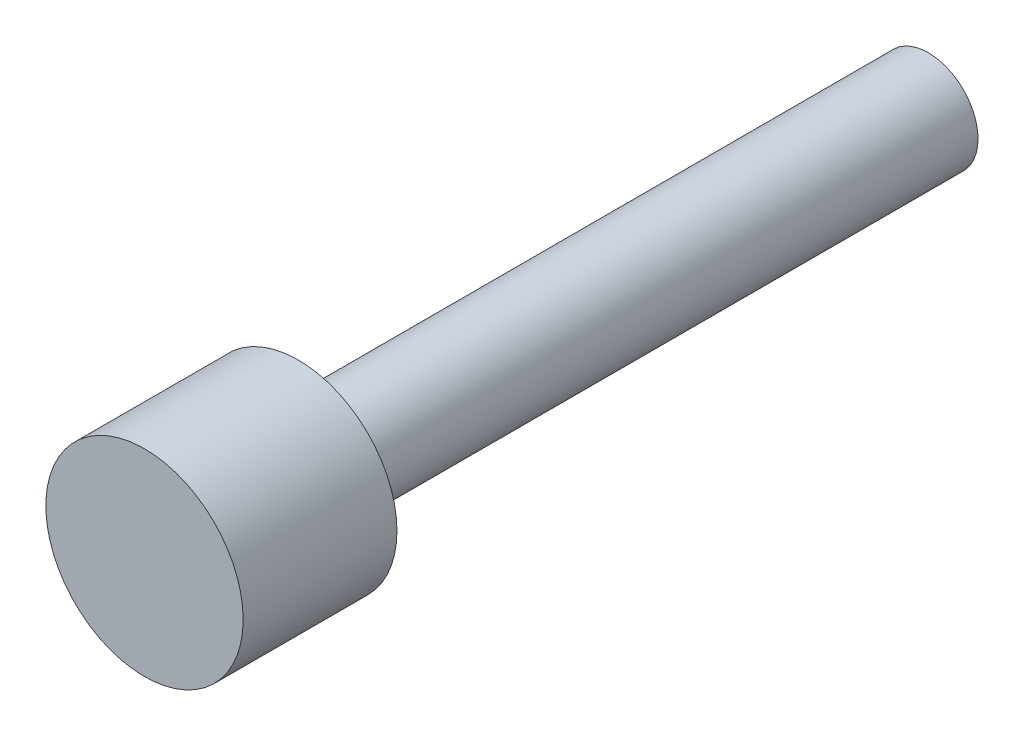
ISO-10303-21;
HEADER;
FILE_DESCRIPTION(('STEP AP214'),'2;1');
FILE_NAME('part.step','',(''),(''),'','','');
FILE_SCHEMA(('AUTOMOTIVE_DESIGN { 1 0 10303 214 1 1 1 1 }'));
ENDSEC;
DATA;
#1=APPLICATION_CONTEXT('core data for automotive mechanical design processes');
#2=APPLICATION_PROTOCOL_DEFINITION('international standard','automotive_design',2000,#1);
#3=PRODUCT_CONTEXT('',#1,'mechanical');
#4=PRODUCT('Part','Part','',(#3));
#5=PRODUCT_RELATED_PRODUCT_CATEGORY('part','',(#4));
#6=PRODUCT_DEFINITION_FORMATION('','',#4);
#7=PRODUCT_DEFINITION_CONTEXT('part definition',#1,'design');
#8=PRODUCT_DEFINITION('design','',#6,#7);
#9=PRODUCT_DEFINITION_SHAPE('','',#8);
#10=(LENGTH_UNIT() NAMED_UNIT(*) SI_UNIT(.MILLI.,.METRE.));
#11=(NAMED_UNIT(*) PLANE_ANGLE_UNIT() SI_UNIT($,.RADIAN.));
#12=(NAMED_UNIT(*) SI_UNIT($,.STERADIAN.) SOLID_ANGLE_UNIT());
#13=UNCERTAINTY_MEASURE_WITH_UNIT(LENGTH_MEASURE(1.E-05),#10,'distance_accuracy_value','');
#14=(GEOMETRIC_REPRESENTATION_CONTEXT(3) GLOBAL_UNCERTAINTY_ASSIGNED_CONTEXT((#13)) GLOBAL_UNIT_ASSIGNED_CONTEXT((#10,
#11,#12)) REPRESENTATION_CONTEXT('',''));
#15=CARTESIAN_POINT('',(0.,0.,0.));
#16=DIRECTION('',(0.,0.,1.));
#17=DIRECTION('',(1.,0.,0.));
#18=AXIS2_PLACEMENT_3D('',#15,#16,#17);
#19=CARTESIAN_POINT('',(0.,0.,-31.3403012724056));
#20=DIRECTION('',(0.,0.,1.));
#21=DIRECTION('',(1.,0.,0.));
#22=AXIS2_PLACEMENT_3D('',#19,#20,#21);
#23=CYLINDRICAL_SURFACE('',#22,7.14375);
#24=CARTESIAN_POINT('',(0.,0.,-11.134725));
#25=DIRECTION('',(0.,0.,1.));
#26=DIRECTION('',(0.,-1.,0.));
#27=AXIS2_PLACEMENT_3D('',#24,#25,#26);
#28=CIRCLE('',#27,7.14375);
#29=CARTESIAN_POINT('',(0.,-7.14375,-11.134725));
#30=VERTEX_POINT('',#29);
#31=EDGE_CURVE('E36',#30,#30,#28,.F.);
#32=ORIENTED_EDGE('',*,*,#31,.F.);
#33=EDGE_LOOP('',(#32));
#34=FACE_BOUND('',#33,.T.);
#35=CARTESIAN_POINT('',(0.,0.,0.));
#36=DIRECTION('',(0.,0.,1.));
#37=DIRECTION('',(1.,0.,0.));
#38=AXIS2_PLACEMENT_3D('',#35,#36,#37);
#39=CIRCLE('',#38,7.14375);
#40=CARTESIAN_POINT('',(7.14375,0.,0.));
#41=VERTEX_POINT('',#40);
#42=EDGE_CURVE('E44',#41,#41,#39,.T.);
#43=ORIENTED_EDGE('',*,*,#42,.F.);
#44=EDGE_LOOP('',(#43));
#45=FACE_BOUND('',#44,.T.);
#46=ADVANCED_FACE('F33',(#34,#45),#23,.T.);
#47=CARTESIAN_POINT('',(0.,0.,0.));
#48=DIRECTION('',(0.,0.,1.));
#49=DIRECTION('',(1.,0.,0.));
#50=AXIS2_PLACEMENT_3D('',#47,#48,#49);
#51=PLANE('',#50);
#52=ORIENTED_EDGE('',*,*,#42,.T.);
#53=EDGE_LOOP('',(#52));
#54=FACE_BOUND('',#53,.T.);
#55=ADVANCED_FACE('F51',(#54),#51,.T.);
#56=CARTESIAN_POINT('',(0.,0.,-11.134725));
#57=DIRECTION('',(0.,0.,1.));
#58=DIRECTION('',(-1.,0.,0.));
#59=AXIS2_PLACEMENT_3D('',#56,#57,#58);
#60=PLANE('',#59);
#61=CARTESIAN_POINT('',(0.,0.,-11.134725));
#62=DIRECTION('',(0.,0.,-1.));
#63=DIRECTION('',(0.,1.,0.));
#64=AXIS2_PLACEMENT_3D('',#61,#62,#63);
#65=CIRCLE('',#64,3.59537);
#66=CARTESIAN_POINT('',(0.,3.59537,-11.134725));
#67=VERTEX_POINT('',#66);
#68=EDGE_CURVE('E10',#67,#67,#65,.T.);
#69=ORIENTED_EDGE('',*,*,#68,.F.);
#70=EDGE_LOOP('',(#69));
#71=FACE_BOUND('',#70,.T.);
#72=ORIENTED_EDGE('',*,*,#31,.T.);
#73=EDGE_LOOP('',(#72));
#74=FACE_BOUND('',#73,.T.);
#75=ADVANCED_FACE('F58',(#71,#74),#60,.F.);
#76=CARTESIAN_POINT('',(0.,0.,-66.9223670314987));
#77=DIRECTION('',(0.,0.,1.));
#78=DIRECTION('',(0.,-1.,0.));
#79=AXIS2_PLACEMENT_3D('',#76,#77,#78);
#80=CYLINDRICAL_SURFACE('',#79,3.59537);
#81=ORIENTED_EDGE('',*,*,#68,.T.);
#82=EDGE_LOOP('',(#81));
#83=FACE_BOUND('',#82,.T.);
#84=CARTESIAN_POINT('',(0.,0.,-56.753125));
#85=DIRECTION('',(0.,0.,-1.));
#86=DIRECTION('',(0.,1.,0.));
#87=AXIS2_PLACEMENT_3D('',#84,#85,#86);
#88=CIRCLE('',#87,3.59537);
#89=CARTESIAN_POINT('',(0.,3.59537,-56.753125));
#90=VERTEX_POINT('',#89);
#91=EDGE_CURVE('E46',#90,#90,#88,.T.);
#92=ORIENTED_EDGE('',*,*,#91,.F.);
#93=EDGE_LOOP('',(#92));
#94=FACE_BOUND('',#93,.T.);
#95=ADVANCED_FACE('F62',(#83,#94),#80,.T.);
#96=CARTESIAN_POINT('',(0.,0.,-56.753125));
#97=DIRECTION('',(0.,0.,-1.));
#98=DIRECTION('',(-1.,0.,0.));
#99=AXIS2_PLACEMENT_3D('',#96,#97,#98);
#100=PLANE('',#99);
#101=ORIENTED_EDGE('',*,*,#91,.T.);
#102=EDGE_LOOP('',(#101));
#103=FACE_BOUND('',#102,.T.);
#104=ADVANCED_FACE('F68',(#103),#100,.T.);
#105=CLOSED_SHELL('',(#46,#55,#75,#95,#104));
#106=MANIFOLD_SOLID_BREP('B2',#105);
#107=ADVANCED_BREP_SHAPE_REPRESENTATION('',(#18,#106),#14);
#108=SHAPE_DEFINITION_REPRESENTATION(#9,#107);
ENDSEC;
END-ISO-10303-21;
